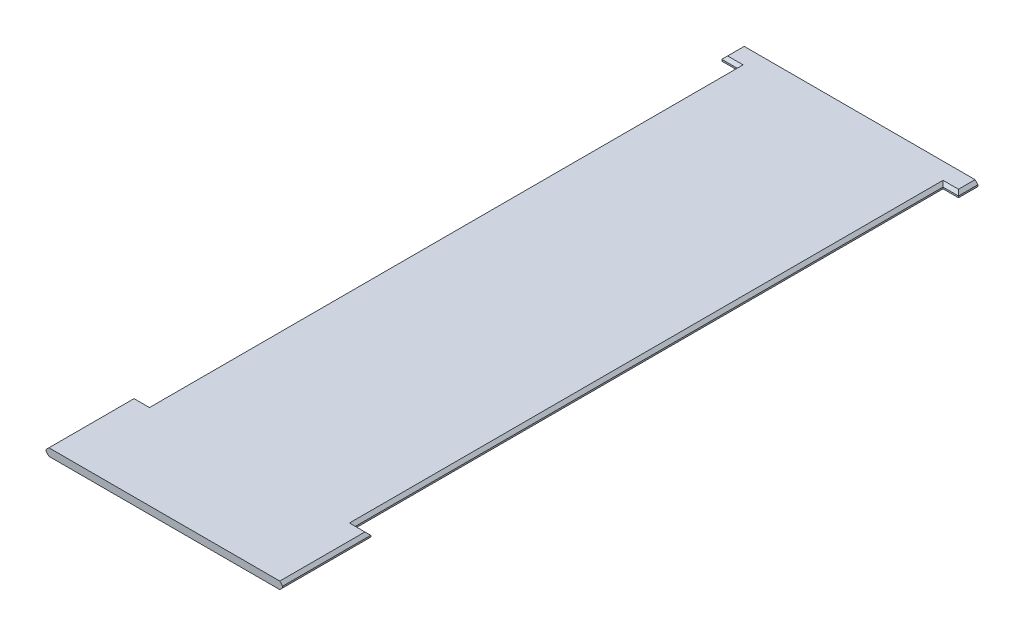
ISO-10303-21;
HEADER;
FILE_DESCRIPTION(('STEP AP214'),'2;1');
FILE_NAME('part.step','',(''),(''),'','','');
FILE_SCHEMA(('AUTOMOTIVE_DESIGN { 1 0 10303 214 1 1 1 1 }'));
ENDSEC;
DATA;
#1=APPLICATION_CONTEXT('core data for automotive mechanical design processes');
#2=APPLICATION_PROTOCOL_DEFINITION('international standard','automotive_design',2000,#1);
#3=PRODUCT_CONTEXT('',#1,'mechanical');
#4=PRODUCT('Part','Part','',(#3));
#5=PRODUCT_RELATED_PRODUCT_CATEGORY('part','',(#4));
#6=PRODUCT_DEFINITION_FORMATION('','',#4);
#7=PRODUCT_DEFINITION_CONTEXT('part definition',#1,'design');
#8=PRODUCT_DEFINITION('design','',#6,#7);
#9=PRODUCT_DEFINITION_SHAPE('','',#8);
#10=(LENGTH_UNIT() NAMED_UNIT(*) SI_UNIT(.MILLI.,.METRE.));
#11=(NAMED_UNIT(*) PLANE_ANGLE_UNIT() SI_UNIT($,.RADIAN.));
#12=(NAMED_UNIT(*) SI_UNIT($,.STERADIAN.) SOLID_ANGLE_UNIT());
#13=UNCERTAINTY_MEASURE_WITH_UNIT(LENGTH_MEASURE(1.E-05),#10,'distance_accuracy_value','');
#14=(GEOMETRIC_REPRESENTATION_CONTEXT(3) GLOBAL_UNCERTAINTY_ASSIGNED_CONTEXT((#13)) GLOBAL_UNIT_ASSIGNED_CONTEXT((#10,
#11,#12)) REPRESENTATION_CONTEXT('',''));
#15=CARTESIAN_POINT('',(0.,0.,0.));
#16=DIRECTION('',(0.,0.,1.));
#17=DIRECTION('',(1.,0.,0.));
#18=AXIS2_PLACEMENT_3D('',#15,#16,#17);
#19=CARTESIAN_POINT('',(553.261641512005,19.05,1566.92811259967));
#20=DIRECTION('',(-1.,0.,0.));
#21=DIRECTION('',(0.,0.,1.));
#22=AXIS2_PLACEMENT_3D('',#19,#20,#21);
#23=PLANE('',#22);
#24=DIRECTION('',(0.,-1.,0.));
#25=VECTOR('',#24,1.);
#26=CARTESIAN_POINT('',(553.261641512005,19.05,2018.12811259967));
#27=LINE('',#26,#25);
#28=CARTESIAN_POINT('',(553.261641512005,4.04999999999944,2018.12811259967));
#29=VERTEX_POINT('',#28);
#30=CARTESIAN_POINT('',(553.261641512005,-4.05000000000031,2018.12811259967));
#31=VERTEX_POINT('',#30);
#32=EDGE_CURVE('E233',#29,#31,#27,.T.);
#33=ORIENTED_EDGE('',*,*,#32,.T.);
#34=DIRECTION('',(0.,0.,-1.));
#35=VECTOR('',#34,1.);
#36=CARTESIAN_POINT('',(553.261641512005,-4.05000000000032,1566.92811259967));
#37=LINE('',#36,#35);
#38=CARTESIAN_POINT('',(553.261641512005,-4.05000000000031,1566.92811259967));
#39=VERTEX_POINT('',#38);
#40=EDGE_CURVE('E11',#31,#39,#37,.T.);
#41=ORIENTED_EDGE('',*,*,#40,.T.);
#42=DIRECTION('',(0.,-1.,0.));
#43=VECTOR('',#42,1.);
#44=CARTESIAN_POINT('',(553.261641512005,19.05,1566.92811259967));
#45=LINE('',#44,#43);
#46=CARTESIAN_POINT('',(553.261641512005,4.04999999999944,1566.92811259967));
#47=VERTEX_POINT('',#46);
#48=EDGE_CURVE('E240',#47,#39,#45,.T.);
#49=ORIENTED_EDGE('',*,*,#48,.F.);
#50=DIRECTION('',(0.,0.,1.));
#51=VECTOR('',#50,1.);
#52=CARTESIAN_POINT('',(553.261641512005,4.04999999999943,1566.92811259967));
#53=LINE('',#52,#51);
#54=EDGE_CURVE('E54',#47,#29,#53,.T.);
#55=ORIENTED_EDGE('',*,*,#54,.T.);
#56=EDGE_LOOP('',(#33,#41,#49,#55));
#57=FACE_BOUND('',#56,.T.);
#58=ADVANCED_FACE('F44',(#57),#23,.F.);
#59=CARTESIAN_POINT('',(474.061641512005,19.05,1566.92811259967));
#60=DIRECTION('',(0.,0.,1.));
#61=DIRECTION('',(1.,0.,0.));
#62=AXIS2_PLACEMENT_3D('',#59,#60,#61);
#63=PLANE('',#62);
#64=ORIENTED_EDGE('',*,*,#48,.T.);
#65=DIRECTION('',(-1.,0.,0.));
#66=VECTOR('',#65,1.);
#67=CARTESIAN_POINT('',(474.061641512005,-4.05000000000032,1566.92811259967));
#68=LINE('',#67,#66);
#69=CARTESIAN_POINT('',(474.061641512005,-4.05000000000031,1566.92811259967));
#70=VERTEX_POINT('',#69);
#71=EDGE_CURVE('E326',#39,#70,#68,.T.);
#72=ORIENTED_EDGE('',*,*,#71,.T.);
#73=DIRECTION('',(0.,-1.,0.));
#74=VECTOR('',#73,1.);
#75=CARTESIAN_POINT('',(474.061641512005,19.05,1566.92811259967));
#76=LINE('',#75,#74);
#77=CARTESIAN_POINT('',(474.061641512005,4.04999999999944,1566.92811259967));
#78=VERTEX_POINT('',#77);
#79=EDGE_CURVE('E241',#78,#70,#76,.T.);
#80=ORIENTED_EDGE('',*,*,#79,.F.);
#81=DIRECTION('',(1.,0.,0.));
#82=VECTOR('',#81,1.);
#83=CARTESIAN_POINT('',(474.061641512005,4.04999999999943,1566.92811259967));
#84=LINE('',#83,#82);
#85=EDGE_CURVE('E70',#78,#47,#84,.T.);
#86=ORIENTED_EDGE('',*,*,#85,.T.);
#87=EDGE_LOOP('',(#64,#72,#80,#86));
#88=FACE_BOUND('',#87,.T.);
#89=ADVANCED_FACE('F540',(#88),#63,.F.);
#90=CARTESIAN_POINT('',(474.061641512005,19.05,-1445.07188740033));
#91=DIRECTION('',(-1.,0.,0.));
#92=DIRECTION('',(0.,0.,1.));
#93=AXIS2_PLACEMENT_3D('',#90,#91,#92);
#94=PLANE('',#93);
#95=ORIENTED_EDGE('',*,*,#79,.T.);
#96=DIRECTION('',(0.,0.,-1.));
#97=VECTOR('',#96,1.);
#98=CARTESIAN_POINT('',(474.061641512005,-4.05000000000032,-1445.07188740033));
#99=LINE('',#98,#97);
#100=CARTESIAN_POINT('',(474.061641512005,-4.05000000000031,-1445.07188740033));
#101=VERTEX_POINT('',#100);
#102=EDGE_CURVE('E321',#70,#101,#99,.T.);
#103=ORIENTED_EDGE('',*,*,#102,.T.);
#104=DIRECTION('',(0.,-1.,0.));
#105=VECTOR('',#104,1.);
#106=CARTESIAN_POINT('',(474.061641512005,19.05,-1445.07188740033));
#107=LINE('',#106,#105);
#108=CARTESIAN_POINT('',(474.061641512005,4.04999999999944,-1445.07188740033));
#109=VERTEX_POINT('',#108);
#110=EDGE_CURVE('E413',#109,#101,#107,.T.);
#111=ORIENTED_EDGE('',*,*,#110,.F.);
#112=DIRECTION('',(0.,0.,1.));
#113=VECTOR('',#112,1.);
#114=CARTESIAN_POINT('',(474.061641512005,4.04999999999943,-1445.07188740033));
#115=LINE('',#114,#113);
#116=EDGE_CURVE('E325',#109,#78,#115,.T.);
#117=ORIENTED_EDGE('',*,*,#116,.T.);
#118=EDGE_LOOP('',(#95,#103,#111,#117));
#119=FACE_BOUND('',#118,.T.);
#120=ADVANCED_FACE('F419',(#119),#94,.F.);
#121=CARTESIAN_POINT('',(474.061641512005,19.05,-1445.07188740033));
#122=DIRECTION('',(0.,0.,-1.));
#123=DIRECTION('',(-1.,0.,0.));
#124=AXIS2_PLACEMENT_3D('',#121,#122,#123);
#125=PLANE('',#124);
#126=ORIENTED_EDGE('',*,*,#110,.T.);
#127=DIRECTION('',(1.,0.,0.));
#128=VECTOR('',#127,1.);
#129=CARTESIAN_POINT('',(553.261641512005,-4.05000000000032,-1445.07188740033));
#130=LINE('',#129,#128);
#131=CARTESIAN_POINT('',(553.261641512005,-4.05000000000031,-1445.07188740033));
#132=VERTEX_POINT('',#131);
#133=EDGE_CURVE('E318',#101,#132,#130,.T.);
#134=ORIENTED_EDGE('',*,*,#133,.T.);
#135=DIRECTION('',(0.,-1.,0.));
#136=VECTOR('',#135,1.);
#137=CARTESIAN_POINT('',(553.261641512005,19.05,-1445.07188740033));
#138=LINE('',#137,#136);
#139=CARTESIAN_POINT('',(553.261641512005,4.04999999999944,-1445.07188740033));
#140=VERTEX_POINT('',#139);
#141=EDGE_CURVE('E414',#140,#132,#138,.T.);
#142=ORIENTED_EDGE('',*,*,#141,.F.);
#143=DIRECTION('',(-1.,0.,0.));
#144=VECTOR('',#143,1.);
#145=CARTESIAN_POINT('',(474.061641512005,4.04999999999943,-1445.07188740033));
#146=LINE('',#145,#144);
#147=EDGE_CURVE('E319',#140,#109,#146,.T.);
#148=ORIENTED_EDGE('',*,*,#147,.T.);
#149=EDGE_LOOP('',(#126,#134,#142,#148));
#150=FACE_BOUND('',#149,.T.);
#151=ADVANCED_FACE('F438',(#150),#125,.F.);
#152=CARTESIAN_POINT('',(553.261641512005,19.05,-1445.07188740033));
#153=DIRECTION('',(-1.,0.,0.));
#154=DIRECTION('',(0.,0.,1.));
#155=AXIS2_PLACEMENT_3D('',#152,#153,#154);
#156=PLANE('',#155);
#157=ORIENTED_EDGE('',*,*,#141,.T.);
#158=DIRECTION('',(0.,0.,-1.));
#159=VECTOR('',#158,1.);
#160=CARTESIAN_POINT('',(553.261641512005,-4.05000000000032,-1545.0718874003));
#161=LINE('',#160,#159);
#162=CARTESIAN_POINT('',(553.261641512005,-4.05000000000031,-1545.0718874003));
#163=VERTEX_POINT('',#162);
#164=EDGE_CURVE('E314',#132,#163,#161,.T.);
#165=ORIENTED_EDGE('',*,*,#164,.T.);
#166=DIRECTION('',(0.,-1.,0.));
#167=VECTOR('',#166,1.);
#168=CARTESIAN_POINT('',(553.261641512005,19.05,-1545.0718874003));
#169=LINE('',#168,#167);
#170=CARTESIAN_POINT('',(553.261641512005,4.04999999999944,-1545.0718874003));
#171=VERTEX_POINT('',#170);
#172=EDGE_CURVE('E409',#171,#163,#169,.T.);
#173=ORIENTED_EDGE('',*,*,#172,.F.);
#174=DIRECTION('',(0.,0.,1.));
#175=VECTOR('',#174,1.);
#176=CARTESIAN_POINT('',(553.261641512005,4.04999999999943,-1445.07188740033));
#177=LINE('',#176,#175);
#178=EDGE_CURVE('E312',#171,#140,#177,.T.);
#179=ORIENTED_EDGE('',*,*,#178,.T.);
#180=EDGE_LOOP('',(#157,#165,#173,#179));
#181=FACE_BOUND('',#180,.T.);
#182=ADVANCED_FACE('F441',(#181),#156,.F.);
#183=CARTESIAN_POINT('',(-659.938358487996,19.05,-1545.0718874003));
#184=DIRECTION('',(0.,0.,1.));
#185=DIRECTION('',(1.,0.,0.));
#186=AXIS2_PLACEMENT_3D('',#183,#184,#185);
#187=PLANE('',#186);
#188=DIRECTION('',(-1.,0.,0.));
#189=VECTOR('',#188,1.);
#190=CARTESIAN_POINT('',(-659.938358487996,-19.05,-1545.0718874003));
#191=LINE('',#190,#189);
#192=CARTESIAN_POINT('',(538.261641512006,-19.05,-1545.0718874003));
#193=VERTEX_POINT('',#192);
#194=CARTESIAN_POINT('',(-644.938358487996,-19.05,-1545.0718874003));
#195=VERTEX_POINT('',#194);
#196=EDGE_CURVE('E344',#193,#195,#191,.T.);
#197=ORIENTED_EDGE('',*,*,#196,.T.);
#198=DIRECTION('',(-0.707106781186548,0.707106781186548,0.));
#199=VECTOR('',#198,1.);
#200=CARTESIAN_POINT('',(-659.938358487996,-4.05000000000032,-1545.0718874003));
#201=LINE('',#200,#199);
#202=CARTESIAN_POINT('',(-659.938358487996,-4.05000000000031,-1545.0718874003));
#203=VERTEX_POINT('',#202);
#204=EDGE_CURVE('E287',#195,#203,#201,.T.);
#205=ORIENTED_EDGE('',*,*,#204,.T.);
#206=DIRECTION('',(0.,-1.,0.));
#207=VECTOR('',#206,1.);
#208=CARTESIAN_POINT('',(-659.938358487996,19.05,-1545.0718874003));
#209=LINE('',#208,#207);
#210=CARTESIAN_POINT('',(-659.938358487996,4.04999999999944,-1545.0718874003));
#211=VERTEX_POINT('',#210);
#212=EDGE_CURVE('E403',#211,#203,#209,.T.);
#213=ORIENTED_EDGE('',*,*,#212,.F.);
#214=DIRECTION('',(-0.707106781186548,-0.707106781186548,0.));
#215=VECTOR('',#214,1.);
#216=CARTESIAN_POINT('',(-644.938358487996,19.05,-1545.0718874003));
#217=LINE('',#216,#215);
#218=CARTESIAN_POINT('',(-644.938358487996,19.05,-1545.0718874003));
#219=VERTEX_POINT('',#218);
#220=EDGE_CURVE('E286',#211,#219,#217,.F.);
#221=ORIENTED_EDGE('',*,*,#220,.T.);
#222=DIRECTION('',(-1.,0.,0.));
#223=VECTOR('',#222,1.);
#224=CARTESIAN_POINT('',(-659.938358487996,19.05,-1545.0718874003));
#225=LINE('',#224,#223);
#226=CARTESIAN_POINT('',(538.261641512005,19.05,-1545.0718874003));
#227=VERTEX_POINT('',#226);
#228=EDGE_CURVE('E386',#227,#219,#225,.T.);
#229=ORIENTED_EDGE('',*,*,#228,.F.);
#230=DIRECTION('',(-0.707106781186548,0.707106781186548,0.));
#231=VECTOR('',#230,1.);
#232=CARTESIAN_POINT('',(538.261641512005,19.05,-1545.0718874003));
#233=LINE('',#232,#231);
#234=EDGE_CURVE('E283',#227,#171,#233,.F.);
#235=ORIENTED_EDGE('',*,*,#234,.T.);
#236=ORIENTED_EDGE('',*,*,#172,.T.);
#237=DIRECTION('',(-0.707106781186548,-0.707106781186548,0.));
#238=VECTOR('',#237,1.);
#239=CARTESIAN_POINT('',(553.261641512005,-4.05000000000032,-1545.0718874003));
#240=LINE('',#239,#238);
#241=EDGE_CURVE('E288',#163,#193,#240,.T.);
#242=ORIENTED_EDGE('',*,*,#241,.T.);
#243=EDGE_LOOP('',(#197,#205,#213,#221,#229,#235,#236,#242));
#244=FACE_BOUND('',#243,.T.);
#245=ADVANCED_FACE('F492',(#244),#187,.F.);
#246=CARTESIAN_POINT('',(-659.938358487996,19.05,-1445.07188740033));
#247=DIRECTION('',(1.,0.,0.));
#248=DIRECTION('',(0.,0.,-1.));
#249=AXIS2_PLACEMENT_3D('',#246,#247,#248);
#250=PLANE('',#249);
#251=ORIENTED_EDGE('',*,*,#212,.T.);
#252=DIRECTION('',(0.,0.,1.));
#253=VECTOR('',#252,1.);
#254=CARTESIAN_POINT('',(-659.938358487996,-4.05000000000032,-1445.07188740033));
#255=LINE('',#254,#253);
#256=CARTESIAN_POINT('',(-659.938358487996,-4.05000000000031,-1445.07188740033));
#257=VERTEX_POINT('',#256);
#258=EDGE_CURVE('E281',#203,#257,#255,.T.);
#259=ORIENTED_EDGE('',*,*,#258,.T.);
#260=DIRECTION('',(0.,-1.,0.));
#261=VECTOR('',#260,1.);
#262=CARTESIAN_POINT('',(-659.938358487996,19.05,-1445.07188740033));
#263=LINE('',#262,#261);
#264=CARTESIAN_POINT('',(-659.938358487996,4.04999999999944,-1445.07188740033));
#265=VERTEX_POINT('',#264);
#266=EDGE_CURVE('E405',#265,#257,#263,.T.);
#267=ORIENTED_EDGE('',*,*,#266,.F.);
#268=DIRECTION('',(0.,0.,-1.));
#269=VECTOR('',#268,1.);
#270=CARTESIAN_POINT('',(-659.938358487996,4.04999999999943,-1445.07188740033));
#271=LINE('',#270,#269);
#272=EDGE_CURVE('E278',#265,#211,#271,.T.);
#273=ORIENTED_EDGE('',*,*,#272,.T.);
#274=EDGE_LOOP('',(#251,#259,#267,#273));
#275=FACE_BOUND('',#274,.T.);
#276=ADVANCED_FACE('F484',(#275),#250,.F.);
#277=CARTESIAN_POINT('',(-580.738358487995,19.05,-1445.07188740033));
#278=DIRECTION('',(0.,0.,-1.));
#279=DIRECTION('',(-1.,0.,0.));
#280=AXIS2_PLACEMENT_3D('',#277,#278,#279);
#281=PLANE('',#280);
#282=ORIENTED_EDGE('',*,*,#266,.T.);
#283=DIRECTION('',(1.,0.,0.));
#284=VECTOR('',#283,1.);
#285=CARTESIAN_POINT('',(-580.738358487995,-4.05000000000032,-1445.07188740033));
#286=LINE('',#285,#284);
#287=CARTESIAN_POINT('',(-580.738358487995,-4.05000000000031,-1445.07188740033));
#288=VERTEX_POINT('',#287);
#289=EDGE_CURVE('E279',#257,#288,#286,.T.);
#290=ORIENTED_EDGE('',*,*,#289,.T.);
#291=DIRECTION('',(0.,-1.,0.));
#292=VECTOR('',#291,1.);
#293=CARTESIAN_POINT('',(-580.738358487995,19.05,-1445.07188740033));
#294=LINE('',#293,#292);
#295=CARTESIAN_POINT('',(-580.738358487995,4.04999999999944,-1445.07188740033));
#296=VERTEX_POINT('',#295);
#297=EDGE_CURVE('E399',#296,#288,#294,.T.);
#298=ORIENTED_EDGE('',*,*,#297,.F.);
#299=DIRECTION('',(-1.,0.,0.));
#300=VECTOR('',#299,1.);
#301=CARTESIAN_POINT('',(-580.738358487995,4.04999999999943,-1445.07188740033));
#302=LINE('',#301,#300);
#303=EDGE_CURVE('E277',#296,#265,#302,.T.);
#304=ORIENTED_EDGE('',*,*,#303,.T.);
#305=EDGE_LOOP('',(#282,#290,#298,#304));
#306=FACE_BOUND('',#305,.T.);
#307=ADVANCED_FACE('F477',(#306),#281,.F.);
#308=CARTESIAN_POINT('',(-580.738358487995,19.05,1566.92811259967));
#309=DIRECTION('',(1.,0.,0.));
#310=DIRECTION('',(0.,0.,-1.));
#311=AXIS2_PLACEMENT_3D('',#308,#309,#310);
#312=PLANE('',#311);
#313=ORIENTED_EDGE('',*,*,#297,.T.);
#314=DIRECTION('',(0.,0.,1.));
#315=VECTOR('',#314,1.);
#316=CARTESIAN_POINT('',(-580.738358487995,-4.05000000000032,1566.92811259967));
#317=LINE('',#316,#315);
#318=CARTESIAN_POINT('',(-580.738358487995,-4.05000000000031,1566.92811259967));
#319=VERTEX_POINT('',#318);
#320=EDGE_CURVE('E274',#288,#319,#317,.T.);
#321=ORIENTED_EDGE('',*,*,#320,.T.);
#322=DIRECTION('',(0.,-1.,0.));
#323=VECTOR('',#322,1.);
#324=CARTESIAN_POINT('',(-580.738358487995,19.05,1566.92811259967));
#325=LINE('',#324,#323);
#326=CARTESIAN_POINT('',(-580.738358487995,4.04999999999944,1566.92811259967));
#327=VERTEX_POINT('',#326);
#328=EDGE_CURVE('E398',#327,#319,#325,.T.);
#329=ORIENTED_EDGE('',*,*,#328,.F.);
#330=DIRECTION('',(0.,0.,-1.));
#331=VECTOR('',#330,1.);
#332=CARTESIAN_POINT('',(-580.738358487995,4.04999999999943,1566.92811259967));
#333=LINE('',#332,#331);
#334=EDGE_CURVE('E275',#327,#296,#333,.T.);
#335=ORIENTED_EDGE('',*,*,#334,.T.);
#336=EDGE_LOOP('',(#313,#321,#329,#335));
#337=FACE_BOUND('',#336,.T.);
#338=ADVANCED_FACE('F470',(#337),#312,.F.);
#339=CARTESIAN_POINT('',(-659.938358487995,19.05,1566.92811259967));
#340=DIRECTION('',(0.,0.,1.));
#341=DIRECTION('',(1.,0.,0.));
#342=AXIS2_PLACEMENT_3D('',#339,#340,#341);
#343=PLANE('',#342);
#344=ORIENTED_EDGE('',*,*,#328,.T.);
#345=DIRECTION('',(-1.,0.,0.));
#346=VECTOR('',#345,1.);
#347=CARTESIAN_POINT('',(-659.938358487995,-4.05000000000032,1566.92811259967));
#348=LINE('',#347,#346);
#349=CARTESIAN_POINT('',(-659.938358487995,-4.05000000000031,1566.92811259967));
#350=VERTEX_POINT('',#349);
#351=EDGE_CURVE('E267',#319,#350,#348,.T.);
#352=ORIENTED_EDGE('',*,*,#351,.T.);
#353=DIRECTION('',(0.,-1.,0.));
#354=VECTOR('',#353,1.);
#355=CARTESIAN_POINT('',(-659.938358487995,19.05,1566.92811259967));
#356=LINE('',#355,#354);
#357=CARTESIAN_POINT('',(-659.938358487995,4.04999999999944,1566.92811259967));
#358=VERTEX_POINT('',#357);
#359=EDGE_CURVE('E229',#358,#350,#356,.T.);
#360=ORIENTED_EDGE('',*,*,#359,.F.);
#361=DIRECTION('',(1.,0.,0.));
#362=VECTOR('',#361,1.);
#363=CARTESIAN_POINT('',(-659.938358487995,4.04999999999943,1566.92811259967));
#364=LINE('',#363,#362);
#365=EDGE_CURVE('E266',#358,#327,#364,.T.);
#366=ORIENTED_EDGE('',*,*,#365,.T.);
#367=EDGE_LOOP('',(#344,#352,#360,#366));
#368=FACE_BOUND('',#367,.T.);
#369=ADVANCED_FACE('F461',(#368),#343,.F.);
#370=CARTESIAN_POINT('',(-659.938358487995,19.05,2018.12811259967));
#371=DIRECTION('',(1.,0.,0.));
#372=DIRECTION('',(0.,0.,-1.));
#373=AXIS2_PLACEMENT_3D('',#370,#371,#372);
#374=PLANE('',#373);
#375=ORIENTED_EDGE('',*,*,#359,.T.);
#376=DIRECTION('',(0.,0.,1.));
#377=VECTOR('',#376,1.);
#378=CARTESIAN_POINT('',(-659.938358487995,-4.05000000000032,2018.12811259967));
#379=LINE('',#378,#377);
#380=CARTESIAN_POINT('',(-659.938358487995,-4.05000000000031,2018.12811259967));
#381=VERTEX_POINT('',#380);
#382=EDGE_CURVE('E230',#350,#381,#379,.T.);
#383=ORIENTED_EDGE('',*,*,#382,.T.);
#384=DIRECTION('',(0.,-1.,0.));
#385=VECTOR('',#384,1.);
#386=CARTESIAN_POINT('',(-659.938358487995,19.05,2018.12811259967));
#387=LINE('',#386,#385);
#388=CARTESIAN_POINT('',(-659.938358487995,4.04999999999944,2018.12811259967));
#389=VERTEX_POINT('',#388);
#390=EDGE_CURVE('E215',#389,#381,#387,.T.);
#391=ORIENTED_EDGE('',*,*,#390,.F.);
#392=DIRECTION('',(0.,0.,-1.));
#393=VECTOR('',#392,1.);
#394=CARTESIAN_POINT('',(-659.938358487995,4.04999999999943,2018.12811259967));
#395=LINE('',#394,#393);
#396=EDGE_CURVE('E228',#389,#358,#395,.T.);
#397=ORIENTED_EDGE('',*,*,#396,.T.);
#398=EDGE_LOOP('',(#375,#383,#391,#397));
#399=FACE_BOUND('',#398,.T.);
#400=ADVANCED_FACE('F222',(#399),#374,.F.);
#401=CARTESIAN_POINT('',(553.261641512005,19.05,2018.12811259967));
#402=DIRECTION('',(0.,0.,-1.));
#403=DIRECTION('',(-1.,0.,0.));
#404=AXIS2_PLACEMENT_3D('',#401,#402,#403);
#405=PLANE('',#404);
#406=ORIENTED_EDGE('',*,*,#390,.T.);
#407=DIRECTION('',(0.707106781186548,-0.707106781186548,0.));
#408=VECTOR('',#407,1.);
#409=CARTESIAN_POINT('',(-659.938358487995,-4.05000000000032,2018.12811259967));
#410=LINE('',#409,#408);
#411=CARTESIAN_POINT('',(-644.938358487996,-19.05,2018.12811259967));
#412=VERTEX_POINT('',#411);
#413=EDGE_CURVE('E218',#381,#412,#410,.T.);
#414=ORIENTED_EDGE('',*,*,#413,.T.);
#415=DIRECTION('',(1.,0.,0.));
#416=VECTOR('',#415,1.);
#417=CARTESIAN_POINT('',(553.261641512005,-19.05,2018.12811259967));
#418=LINE('',#417,#416);
#419=CARTESIAN_POINT('',(538.261641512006,-19.05,2018.12811259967));
#420=VERTEX_POINT('',#419);
#421=EDGE_CURVE('E391',#412,#420,#418,.T.);
#422=ORIENTED_EDGE('',*,*,#421,.T.);
#423=DIRECTION('',(0.707106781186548,0.707106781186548,0.));
#424=VECTOR('',#423,1.);
#425=CARTESIAN_POINT('',(553.261641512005,-4.05000000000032,2018.12811259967));
#426=LINE('',#425,#424);
#427=EDGE_CURVE('E217',#420,#31,#426,.T.);
#428=ORIENTED_EDGE('',*,*,#427,.T.);
#429=ORIENTED_EDGE('',*,*,#32,.F.);
#430=DIRECTION('',(0.707106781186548,-0.707106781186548,0.));
#431=VECTOR('',#430,1.);
#432=CARTESIAN_POINT('',(538.261641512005,19.05,2018.12811259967));
#433=LINE('',#432,#431);
#434=CARTESIAN_POINT('',(538.261641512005,19.05,2018.12811259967));
#435=VERTEX_POINT('',#434);
#436=EDGE_CURVE('E237',#29,#435,#433,.F.);
#437=ORIENTED_EDGE('',*,*,#436,.T.);
#438=DIRECTION('',(1.,0.,0.));
#439=VECTOR('',#438,1.);
#440=CARTESIAN_POINT('',(553.261641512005,19.05,2018.12811259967));
#441=LINE('',#440,#439);
#442=CARTESIAN_POINT('',(-644.938358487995,19.05,2018.12811259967));
#443=VERTEX_POINT('',#442);
#444=EDGE_CURVE('E211',#443,#435,#441,.T.);
#445=ORIENTED_EDGE('',*,*,#444,.F.);
#446=DIRECTION('',(0.707106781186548,0.707106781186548,0.));
#447=VECTOR('',#446,1.);
#448=CARTESIAN_POINT('',(-644.938358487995,19.05,2018.12811259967));
#449=LINE('',#448,#447);
#450=EDGE_CURVE('E209',#443,#389,#449,.F.);
#451=ORIENTED_EDGE('',*,*,#450,.T.);
#452=EDGE_LOOP('',(#406,#414,#422,#428,#429,#437,#445,#451));
#453=FACE_BOUND('',#452,.T.);
#454=ADVANCED_FACE('F212',(#453),#405,.F.);
#455=CARTESIAN_POINT('',(0.,19.05,0.));
#456=DIRECTION('',(0.,-1.,0.));
#457=DIRECTION('',(0.,0.,-1.));
#458=AXIS2_PLACEMENT_3D('',#455,#456,#457);
#459=PLANE('',#458);
#460=DIRECTION('',(-1.,0.,0.));
#461=VECTOR('',#460,1.);
#462=CARTESIAN_POINT('',(0.,19.05,1581.92811259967));
#463=LINE('',#462,#461);
#464=CARTESIAN_POINT('',(-565.738358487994,19.05,1581.92811259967));
#465=VERTEX_POINT('',#464);
#466=CARTESIAN_POINT('',(-644.938358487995,19.05,1581.92811259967));
#467=VERTEX_POINT('',#466);
#468=EDGE_CURVE('E307',#465,#467,#463,.T.);
#469=ORIENTED_EDGE('',*,*,#468,.T.);
#470=DIRECTION('',(0.,0.,1.));
#471=VECTOR('',#470,1.);
#472=CARTESIAN_POINT('',(-644.938358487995,19.05,0.));
#473=LINE('',#472,#471);
#474=EDGE_CURVE('E311',#467,#443,#473,.T.);
#475=ORIENTED_EDGE('',*,*,#474,.T.);
#476=ORIENTED_EDGE('',*,*,#444,.T.);
#477=DIRECTION('',(0.,0.,-1.));
#478=VECTOR('',#477,1.);
#479=CARTESIAN_POINT('',(538.261641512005,19.05,0.));
#480=LINE('',#479,#478);
#481=CARTESIAN_POINT('',(538.261641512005,19.05,1581.92811259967));
#482=VERTEX_POINT('',#481);
#483=EDGE_CURVE('E292',#435,#482,#480,.T.);
#484=ORIENTED_EDGE('',*,*,#483,.T.);
#485=DIRECTION('',(-1.,0.,0.));
#486=VECTOR('',#485,1.);
#487=CARTESIAN_POINT('',(0.,19.05,1581.92811259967));
#488=LINE('',#487,#486);
#489=CARTESIAN_POINT('',(459.061641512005,19.05,1581.92811259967));
#490=VERTEX_POINT('',#489);
#491=EDGE_CURVE('E295',#482,#490,#488,.T.);
#492=ORIENTED_EDGE('',*,*,#491,.T.);
#493=DIRECTION('',(0.,0.,-1.));
#494=VECTOR('',#493,1.);
#495=CARTESIAN_POINT('',(459.061641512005,19.05,0.));
#496=LINE('',#495,#494);
#497=CARTESIAN_POINT('',(459.061641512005,19.05,-1460.07188740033));
#498=VERTEX_POINT('',#497);
#499=EDGE_CURVE('E298',#490,#498,#496,.T.);
#500=ORIENTED_EDGE('',*,*,#499,.T.);
#501=DIRECTION('',(1.,0.,0.));
#502=VECTOR('',#501,1.);
#503=CARTESIAN_POINT('',(0.,19.05,-1460.07188740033));
#504=LINE('',#503,#502);
#505=CARTESIAN_POINT('',(538.261641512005,19.05,-1460.07188740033));
#506=VERTEX_POINT('',#505);
#507=EDGE_CURVE('E296',#498,#506,#504,.T.);
#508=ORIENTED_EDGE('',*,*,#507,.T.);
#509=DIRECTION('',(0.,0.,-1.));
#510=VECTOR('',#509,1.);
#511=CARTESIAN_POINT('',(538.261641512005,19.05,0.));
#512=LINE('',#511,#510);
#513=EDGE_CURVE('E297',#506,#227,#512,.T.);
#514=ORIENTED_EDGE('',*,*,#513,.T.);
#515=ORIENTED_EDGE('',*,*,#228,.T.);
#516=DIRECTION('',(0.,0.,1.));
#517=VECTOR('',#516,1.);
#518=CARTESIAN_POINT('',(-644.938358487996,19.05,0.));
#519=LINE('',#518,#517);
#520=CARTESIAN_POINT('',(-644.938358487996,19.05,-1460.07188740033));
#521=VERTEX_POINT('',#520);
#522=EDGE_CURVE('E303',#219,#521,#519,.T.);
#523=ORIENTED_EDGE('',*,*,#522,.T.);
#524=DIRECTION('',(1.,0.,0.));
#525=VECTOR('',#524,1.);
#526=CARTESIAN_POINT('',(0.,19.05,-1460.07188740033));
#527=LINE('',#526,#525);
#528=CARTESIAN_POINT('',(-565.738358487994,19.05,-1460.07188740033));
#529=VERTEX_POINT('',#528);
#530=EDGE_CURVE('E304',#521,#529,#527,.T.);
#531=ORIENTED_EDGE('',*,*,#530,.T.);
#532=DIRECTION('',(0.,0.,1.));
#533=VECTOR('',#532,1.);
#534=CARTESIAN_POINT('',(-565.738358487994,19.05,0.));
#535=LINE('',#534,#533);
#536=EDGE_CURVE('E310',#529,#465,#535,.T.);
#537=ORIENTED_EDGE('',*,*,#536,.T.);
#538=EDGE_LOOP('',(#469,#475,#476,#484,#492,#500,#508,#514,#515,#523,#531,#537));
#539=FACE_BOUND('',#538,.T.);
#540=ADVANCED_FACE('F451',(#539),#459,.F.);
#541=CARTESIAN_POINT('',(0.,-19.05,0.));
#542=DIRECTION('',(0.,-1.,0.));
#543=DIRECTION('',(0.,0.,-1.));
#544=AXIS2_PLACEMENT_3D('',#541,#542,#543);
#545=PLANE('',#544);
#546=ORIENTED_EDGE('',*,*,#421,.F.);
#547=DIRECTION('',(0.,0.,-1.));
#548=VECTOR('',#547,1.);
#549=CARTESIAN_POINT('',(-644.938358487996,-19.05,1566.92811259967));
#550=LINE('',#549,#548);
#551=CARTESIAN_POINT('',(-644.938358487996,-19.05,1581.92811259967));
#552=VERTEX_POINT('',#551);
#553=EDGE_CURVE('E268',#412,#552,#550,.T.);
#554=ORIENTED_EDGE('',*,*,#553,.T.);
#555=DIRECTION('',(1.,0.,0.));
#556=VECTOR('',#555,1.);
#557=CARTESIAN_POINT('',(-580.738358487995,-19.05,1581.92811259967));
#558=LINE('',#557,#556);
#559=CARTESIAN_POINT('',(-565.738358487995,-19.05,1581.92811259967));
#560=VERTEX_POINT('',#559);
#561=EDGE_CURVE('E263',#552,#560,#558,.T.);
#562=ORIENTED_EDGE('',*,*,#561,.T.);
#563=DIRECTION('',(0.,0.,-1.));
#564=VECTOR('',#563,1.);
#565=CARTESIAN_POINT('',(-565.738358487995,-19.05,-1445.07188740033));
#566=LINE('',#565,#564);
#567=CARTESIAN_POINT('',(-565.738358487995,-19.05,-1460.07188740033));
#568=VERTEX_POINT('',#567);
#569=EDGE_CURVE('E261',#560,#568,#566,.T.);
#570=ORIENTED_EDGE('',*,*,#569,.T.);
#571=DIRECTION('',(-1.,0.,0.));
#572=VECTOR('',#571,1.);
#573=CARTESIAN_POINT('',(-659.938358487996,-19.05,-1460.07188740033));
#574=LINE('',#573,#572);
#575=CARTESIAN_POINT('',(-644.938358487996,-19.05,-1460.07188740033));
#576=VERTEX_POINT('',#575);
#577=EDGE_CURVE('E258',#568,#576,#574,.T.);
#578=ORIENTED_EDGE('',*,*,#577,.T.);
#579=DIRECTION('',(0.,0.,-1.));
#580=VECTOR('',#579,1.);
#581=CARTESIAN_POINT('',(-644.938358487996,-19.05,-1545.0718874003));
#582=LINE('',#581,#580);
#583=EDGE_CURVE('E259',#576,#195,#582,.T.);
#584=ORIENTED_EDGE('',*,*,#583,.T.);
#585=ORIENTED_EDGE('',*,*,#196,.F.);
#586=DIRECTION('',(0.,0.,1.));
#587=VECTOR('',#586,1.);
#588=CARTESIAN_POINT('',(538.261641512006,-19.05,-1445.07188740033));
#589=LINE('',#588,#587);
#590=CARTESIAN_POINT('',(538.261641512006,-19.05,-1460.07188740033));
#591=VERTEX_POINT('',#590);
#592=EDGE_CURVE('E257',#193,#591,#589,.T.);
#593=ORIENTED_EDGE('',*,*,#592,.T.);
#594=DIRECTION('',(-1.,0.,0.));
#595=VECTOR('',#594,1.);
#596=CARTESIAN_POINT('',(474.061641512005,-19.05,-1460.07188740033));
#597=LINE('',#596,#595);
#598=CARTESIAN_POINT('',(459.061641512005,-19.05,-1460.07188740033));
#599=VERTEX_POINT('',#598);
#600=EDGE_CURVE('E251',#591,#599,#597,.T.);
#601=ORIENTED_EDGE('',*,*,#600,.T.);
#602=DIRECTION('',(0.,0.,1.));
#603=VECTOR('',#602,1.);
#604=CARTESIAN_POINT('',(459.061641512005,-19.05,1566.92811259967));
#605=LINE('',#604,#603);
#606=CARTESIAN_POINT('',(459.061641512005,-19.05,1581.92811259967));
#607=VERTEX_POINT('',#606);
#608=EDGE_CURVE('E255',#599,#607,#605,.T.);
#609=ORIENTED_EDGE('',*,*,#608,.T.);
#610=DIRECTION('',(1.,0.,0.));
#611=VECTOR('',#610,1.);
#612=CARTESIAN_POINT('',(553.261641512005,-19.05,1581.92811259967));
#613=LINE('',#612,#611);
#614=CARTESIAN_POINT('',(538.261641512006,-19.05,1581.92811259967));
#615=VERTEX_POINT('',#614);
#616=EDGE_CURVE('E249',#607,#615,#613,.T.);
#617=ORIENTED_EDGE('',*,*,#616,.T.);
#618=DIRECTION('',(0.,0.,1.));
#619=VECTOR('',#618,1.);
#620=CARTESIAN_POINT('',(538.261641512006,-19.05,2018.12811259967));
#621=LINE('',#620,#619);
#622=EDGE_CURVE('E247',#615,#420,#621,.T.);
#623=ORIENTED_EDGE('',*,*,#622,.T.);
#624=EDGE_LOOP('',(#546,#554,#562,#570,#578,#584,#585,#593,#601,#609,#617,#623));
#625=FACE_BOUND('',#624,.T.);
#626=ADVANCED_FACE('F524',(#625),#545,.T.);
#627=CARTESIAN_POINT('',(-659.938358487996,-4.05000000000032,-1445.07188740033));
#628=DIRECTION('',(-0.707106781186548,-0.707106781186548,0.));
#629=DIRECTION('',(0.,0.,-1.));
#630=AXIS2_PLACEMENT_3D('',#627,#628,#629);
#631=PLANE('',#630);
#632=ORIENTED_EDGE('',*,*,#204,.F.);
#633=ORIENTED_EDGE('',*,*,#583,.F.);
#634=DIRECTION('',(-0.577350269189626,0.577350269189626,0.577350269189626));
#635=VECTOR('',#634,1.);
#636=CARTESIAN_POINT('',(-659.938358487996,-4.05000000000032,-1445.07188740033));
#637=LINE('',#636,#635);
#638=EDGE_CURVE('E338',#257,#576,#637,.F.);
#639=ORIENTED_EDGE('',*,*,#638,.F.);
#640=ORIENTED_EDGE('',*,*,#258,.F.);
#641=EDGE_LOOP('',(#632,#633,#639,#640));
#642=FACE_BOUND('',#641,.T.);
#643=ADVANCED_FACE('F503',(#642),#631,.T.);
#644=CARTESIAN_POINT('',(-580.738358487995,-4.05000000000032,-1445.07188740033));
#645=DIRECTION('',(0.,-0.707106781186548,0.707106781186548));
#646=DIRECTION('',(-1.,0.,0.));
#647=AXIS2_PLACEMENT_3D('',#644,#645,#646);
#648=PLANE('',#647);
#649=ORIENTED_EDGE('',*,*,#638,.T.);
#650=ORIENTED_EDGE('',*,*,#577,.F.);
#651=DIRECTION('',(-0.577350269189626,0.577350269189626,0.577350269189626));
#652=VECTOR('',#651,1.);
#653=CARTESIAN_POINT('',(-1584.73835848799,999.949999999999,-441.071887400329));
#654=LINE('',#653,#652);
#655=EDGE_CURVE('E340',#288,#568,#654,.F.);
#656=ORIENTED_EDGE('',*,*,#655,.F.);
#657=ORIENTED_EDGE('',*,*,#289,.F.);
#658=EDGE_LOOP('',(#649,#650,#656,#657));
#659=FACE_BOUND('',#658,.T.);
#660=ADVANCED_FACE('F507',(#659),#648,.T.);
#661=CARTESIAN_POINT('',(-580.738358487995,-4.05000000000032,1566.92811259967));
#662=DIRECTION('',(-0.707106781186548,-0.707106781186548,0.));
#663=DIRECTION('',(0.,0.,-1.));
#664=AXIS2_PLACEMENT_3D('',#661,#662,#663);
#665=PLANE('',#664);
#666=ORIENTED_EDGE('',*,*,#655,.T.);
#667=ORIENTED_EDGE('',*,*,#569,.F.);
#668=DIRECTION('',(-0.577350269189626,0.577350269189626,-0.577350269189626));
#669=VECTOR('',#668,1.);
#670=CARTESIAN_POINT('',(-607.138358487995,22.3499999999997,1540.52811259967));
#671=LINE('',#670,#669);
#672=EDGE_CURVE('E331',#319,#560,#671,.F.);
#673=ORIENTED_EDGE('',*,*,#672,.F.);
#674=ORIENTED_EDGE('',*,*,#320,.F.);
#675=EDGE_LOOP('',(#666,#667,#673,#674));
#676=FACE_BOUND('',#675,.T.);
#677=ADVANCED_FACE('F512',(#676),#665,.T.);
#678=CARTESIAN_POINT('',(-659.938358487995,-4.05000000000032,1566.92811259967));
#679=DIRECTION('',(0.,-0.707106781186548,-0.707106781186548));
#680=DIRECTION('',(1.,0.,0.));
#681=AXIS2_PLACEMENT_3D('',#678,#679,#680);
#682=PLANE('',#681);
#683=ORIENTED_EDGE('',*,*,#672,.T.);
#684=ORIENTED_EDGE('',*,*,#561,.F.);
#685=DIRECTION('',(-0.577350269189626,0.577350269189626,-0.577350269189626));
#686=VECTOR('',#685,1.);
#687=CARTESIAN_POINT('',(-659.938358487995,-4.05000000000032,1566.92811259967));
#688=LINE('',#687,#686);
#689=EDGE_CURVE('E327',#350,#552,#688,.F.);
#690=ORIENTED_EDGE('',*,*,#689,.F.);
#691=ORIENTED_EDGE('',*,*,#351,.F.);
#692=EDGE_LOOP('',(#683,#684,#690,#691));
#693=FACE_BOUND('',#692,.T.);
#694=ADVANCED_FACE('F517',(#693),#682,.T.);
#695=CARTESIAN_POINT('',(-659.938358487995,-4.05000000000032,2018.12811259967));
#696=DIRECTION('',(-0.707106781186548,-0.707106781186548,0.));
#697=DIRECTION('',(0.,0.,-1.));
#698=AXIS2_PLACEMENT_3D('',#695,#696,#697);
#699=PLANE('',#698);
#700=ORIENTED_EDGE('',*,*,#689,.T.);
#701=ORIENTED_EDGE('',*,*,#553,.F.);
#702=ORIENTED_EDGE('',*,*,#413,.F.);
#703=ORIENTED_EDGE('',*,*,#382,.F.);
#704=EDGE_LOOP('',(#700,#701,#702,#703));
#705=FACE_BOUND('',#704,.T.);
#706=ADVANCED_FACE('F516',(#705),#699,.T.);
#707=CARTESIAN_POINT('',(-644.938358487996,19.05,0.));
#708=DIRECTION('',(0.707106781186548,-0.707106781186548,0.));
#709=DIRECTION('',(0.,0.,1.));
#710=AXIS2_PLACEMENT_3D('',#707,#708,#709);
#711=PLANE('',#710);
#712=ORIENTED_EDGE('',*,*,#220,.F.);
#713=ORIENTED_EDGE('',*,*,#272,.F.);
#714=DIRECTION('',(0.577350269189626,0.577350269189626,-0.577350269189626));
#715=VECTOR('',#714,1.);
#716=CARTESIAN_POINT('',(-1131.62898762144,-467.640629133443,-973.381258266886));
#717=LINE('',#716,#715);
#718=EDGE_CURVE('E334',#521,#265,#717,.F.);
#719=ORIENTED_EDGE('',*,*,#718,.F.);
#720=ORIENTED_EDGE('',*,*,#522,.F.);
#721=EDGE_LOOP('',(#712,#713,#719,#720));
#722=FACE_BOUND('',#721,.T.);
#723=ADVANCED_FACE('F490',(#722),#711,.F.);
#724=CARTESIAN_POINT('',(0.,19.05,-1460.07188740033));
#725=DIRECTION('',(0.,-0.707106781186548,-0.707106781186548));
#726=DIRECTION('',(1.,0.,0.));
#727=AXIS2_PLACEMENT_3D('',#724,#725,#726);
#728=PLANE('',#727);
#729=ORIENTED_EDGE('',*,*,#718,.T.);
#730=ORIENTED_EDGE('',*,*,#303,.F.);
#731=DIRECTION('',(0.577350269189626,0.577350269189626,-0.577350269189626));
#732=VECTOR('',#731,1.);
#733=CARTESIAN_POINT('',(-1052.42898762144,-467.640629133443,-973.381258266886));
#734=LINE('',#733,#732);
#735=EDGE_CURVE('E348',#529,#296,#734,.F.);
#736=ORIENTED_EDGE('',*,*,#735,.F.);
#737=ORIENTED_EDGE('',*,*,#530,.F.);
#738=EDGE_LOOP('',(#729,#730,#736,#737));
#739=FACE_BOUND('',#738,.T.);
#740=ADVANCED_FACE('F479',(#739),#728,.F.);
#741=CARTESIAN_POINT('',(-565.738358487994,19.05,0.));
#742=DIRECTION('',(0.707106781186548,-0.707106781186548,0.));
#743=DIRECTION('',(0.,0.,1.));
#744=AXIS2_PLACEMENT_3D('',#741,#742,#743);
#745=PLANE('',#744);
#746=ORIENTED_EDGE('',*,*,#735,.T.);
#747=ORIENTED_EDGE('',*,*,#334,.F.);
#748=DIRECTION('',(0.577350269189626,0.577350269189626,0.577350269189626));
#749=VECTOR('',#748,1.);
#750=CARTESIAN_POINT('',(-377.158905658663,207.629452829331,1770.507565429));
#751=LINE('',#750,#749);
#752=EDGE_CURVE('E343',#465,#327,#751,.F.);
#753=ORIENTED_EDGE('',*,*,#752,.F.);
#754=ORIENTED_EDGE('',*,*,#536,.F.);
#755=EDGE_LOOP('',(#746,#747,#753,#754));
#756=FACE_BOUND('',#755,.T.);
#757=ADVANCED_FACE('F472',(#756),#745,.F.);
#758=CARTESIAN_POINT('',(0.,19.05,1581.92811259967));
#759=DIRECTION('',(0.,-0.707106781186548,0.707106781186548));
#760=DIRECTION('',(-1.,0.,0.));
#761=AXIS2_PLACEMENT_3D('',#758,#759,#760);
#762=PLANE('',#761);
#763=ORIENTED_EDGE('',*,*,#752,.T.);
#764=ORIENTED_EDGE('',*,*,#365,.F.);
#765=DIRECTION('',(0.577350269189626,0.577350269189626,0.577350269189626));
#766=VECTOR('',#765,1.);
#767=CARTESIAN_POINT('',(-429.958905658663,234.029452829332,1796.907565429));
#768=LINE('',#767,#766);
#769=EDGE_CURVE('E236',#467,#358,#768,.F.);
#770=ORIENTED_EDGE('',*,*,#769,.F.);
#771=ORIENTED_EDGE('',*,*,#468,.F.);
#772=EDGE_LOOP('',(#763,#764,#770,#771));
#773=FACE_BOUND('',#772,.T.);
#774=ADVANCED_FACE('F457',(#773),#762,.F.);
#775=CARTESIAN_POINT('',(-644.938358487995,19.05,0.));
#776=DIRECTION('',(0.707106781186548,-0.707106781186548,0.));
#777=DIRECTION('',(0.,0.,1.));
#778=AXIS2_PLACEMENT_3D('',#775,#776,#777);
#779=PLANE('',#778);
#780=ORIENTED_EDGE('',*,*,#769,.T.);
#781=ORIENTED_EDGE('',*,*,#396,.F.);
#782=ORIENTED_EDGE('',*,*,#450,.F.);
#783=ORIENTED_EDGE('',*,*,#474,.F.);
#784=EDGE_LOOP('',(#780,#781,#782,#783));
#785=FACE_BOUND('',#784,.T.);
#786=ADVANCED_FACE('F234',(#785),#779,.F.);
#787=CARTESIAN_POINT('',(553.261641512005,-4.05000000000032,1566.92811259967));
#788=DIRECTION('',(0.707106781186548,-0.707106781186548,0.));
#789=DIRECTION('',(0.,0.,1.));
#790=AXIS2_PLACEMENT_3D('',#787,#788,#789);
#791=PLANE('',#790);
#792=ORIENTED_EDGE('',*,*,#427,.F.);
#793=ORIENTED_EDGE('',*,*,#622,.F.);
#794=DIRECTION('',(0.577350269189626,0.577350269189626,-0.577350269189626));
#795=VECTOR('',#794,1.);
#796=CARTESIAN_POINT('',(553.261641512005,-4.05000000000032,1566.92811259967));
#797=LINE('',#796,#795);
#798=EDGE_CURVE('E349',#39,#615,#797,.F.);
#799=ORIENTED_EDGE('',*,*,#798,.F.);
#800=ORIENTED_EDGE('',*,*,#40,.F.);
#801=EDGE_LOOP('',(#792,#793,#799,#800));
#802=FACE_BOUND('',#801,.T.);
#803=ADVANCED_FACE('F522',(#802),#791,.T.);
#804=CARTESIAN_POINT('',(474.061641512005,-4.05000000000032,1566.92811259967));
#805=DIRECTION('',(0.,-0.707106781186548,-0.707106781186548));
#806=DIRECTION('',(1.,0.,0.));
#807=AXIS2_PLACEMENT_3D('',#804,#805,#806);
#808=PLANE('',#807);
#809=ORIENTED_EDGE('',*,*,#798,.T.);
#810=ORIENTED_EDGE('',*,*,#616,.F.);
#811=DIRECTION('',(0.577350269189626,0.577350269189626,-0.577350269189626));
#812=VECTOR('',#811,1.);
#813=CARTESIAN_POINT('',(1478.061641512,999.949999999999,562.92811259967));
#814=LINE('',#813,#812);
#815=EDGE_CURVE('E359',#70,#607,#814,.F.);
#816=ORIENTED_EDGE('',*,*,#815,.F.);
#817=ORIENTED_EDGE('',*,*,#71,.F.);
#818=EDGE_LOOP('',(#809,#810,#816,#817));
#819=FACE_BOUND('',#818,.T.);
#820=ADVANCED_FACE('F424',(#819),#808,.T.);
#821=CARTESIAN_POINT('',(474.061641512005,-4.05000000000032,-1445.07188740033));
#822=DIRECTION('',(0.707106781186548,-0.707106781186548,0.));
#823=DIRECTION('',(0.,0.,1.));
#824=AXIS2_PLACEMENT_3D('',#821,#822,#823);
#825=PLANE('',#824);
#826=ORIENTED_EDGE('',*,*,#815,.T.);
#827=ORIENTED_EDGE('',*,*,#608,.F.);
#828=DIRECTION('',(0.577350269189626,0.577350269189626,0.577350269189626));
#829=VECTOR('',#828,1.);
#830=CARTESIAN_POINT('',(474.061641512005,-4.05000000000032,-1445.07188740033));
#831=LINE('',#830,#829);
#832=EDGE_CURVE('E357',#101,#599,#831,.F.);
#833=ORIENTED_EDGE('',*,*,#832,.F.);
#834=ORIENTED_EDGE('',*,*,#102,.F.);
#835=EDGE_LOOP('',(#826,#827,#833,#834));
#836=FACE_BOUND('',#835,.T.);
#837=ADVANCED_FACE('F429',(#836),#825,.T.);
#838=CARTESIAN_POINT('',(474.061641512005,-4.05000000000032,-1445.07188740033));
#839=DIRECTION('',(0.,-0.707106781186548,0.707106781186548));
#840=DIRECTION('',(-1.,0.,0.));
#841=AXIS2_PLACEMENT_3D('',#838,#839,#840);
#842=PLANE('',#841);
#843=ORIENTED_EDGE('',*,*,#832,.T.);
#844=ORIENTED_EDGE('',*,*,#600,.F.);
#845=DIRECTION('',(0.577350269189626,0.577350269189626,0.577350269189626));
#846=VECTOR('',#845,1.);
#847=CARTESIAN_POINT('',(526.861641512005,-30.4500000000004,-1471.47188740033));
#848=LINE('',#847,#846);
#849=EDGE_CURVE('E354',#132,#591,#848,.F.);
#850=ORIENTED_EDGE('',*,*,#849,.F.);
#851=ORIENTED_EDGE('',*,*,#133,.F.);
#852=EDGE_LOOP('',(#843,#844,#850,#851));
#853=FACE_BOUND('',#852,.T.);
#854=ADVANCED_FACE('F432',(#853),#842,.T.);
#855=CARTESIAN_POINT('',(553.261641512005,-4.05000000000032,-1445.07188740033));
#856=DIRECTION('',(0.707106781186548,-0.707106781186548,0.));
#857=DIRECTION('',(0.,0.,1.));
#858=AXIS2_PLACEMENT_3D('',#855,#856,#857);
#859=PLANE('',#858);
#860=ORIENTED_EDGE('',*,*,#849,.T.);
#861=ORIENTED_EDGE('',*,*,#592,.F.);
#862=ORIENTED_EDGE('',*,*,#241,.F.);
#863=ORIENTED_EDGE('',*,*,#164,.F.);
#864=EDGE_LOOP('',(#860,#861,#862,#863));
#865=FACE_BOUND('',#864,.T.);
#866=ADVANCED_FACE('F594',(#865),#859,.T.);
#867=CARTESIAN_POINT('',(538.261641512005,19.05,0.));
#868=DIRECTION('',(-0.707106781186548,-0.707106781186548,0.));
#869=DIRECTION('',(0.,0.,-1.));
#870=AXIS2_PLACEMENT_3D('',#867,#868,#869);
#871=PLANE('',#870);
#872=ORIENTED_EDGE('',*,*,#436,.F.);
#873=ORIENTED_EDGE('',*,*,#54,.F.);
#874=DIRECTION('',(-0.577350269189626,0.577350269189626,0.577350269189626));
#875=VECTOR('',#874,1.);
#876=CARTESIAN_POINT('',(1065.57101237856,-508.259370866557,1054.61874173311));
#877=LINE('',#876,#875);
#878=EDGE_CURVE('E49',#482,#47,#877,.F.);
#879=ORIENTED_EDGE('',*,*,#878,.F.);
#880=ORIENTED_EDGE('',*,*,#483,.F.);
#881=EDGE_LOOP('',(#872,#873,#879,#880));
#882=FACE_BOUND('',#881,.T.);
#883=ADVANCED_FACE('F48',(#882),#871,.F.);
#884=CARTESIAN_POINT('',(0.,19.05,1581.92811259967));
#885=DIRECTION('',(0.,-0.707106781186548,0.707106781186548));
#886=DIRECTION('',(-1.,0.,0.));
#887=AXIS2_PLACEMENT_3D('',#884,#885,#886);
#888=PLANE('',#887);
#889=ORIENTED_EDGE('',*,*,#878,.T.);
#890=ORIENTED_EDGE('',*,*,#85,.F.);
#891=DIRECTION('',(-0.577350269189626,0.577350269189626,0.577350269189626));
#892=VECTOR('',#891,1.);
#893=CARTESIAN_POINT('',(986.371012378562,-508.259370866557,1054.61874173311));
#894=LINE('',#893,#892);
#895=EDGE_CURVE('E369',#490,#78,#894,.F.);
#896=ORIENTED_EDGE('',*,*,#895,.F.);
#897=ORIENTED_EDGE('',*,*,#491,.F.);
#898=EDGE_LOOP('',(#889,#890,#896,#897));
#899=FACE_BOUND('',#898,.T.);
#900=ADVANCED_FACE('F379',(#899),#888,.F.);
#901=CARTESIAN_POINT('',(459.061641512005,19.05,0.));
#902=DIRECTION('',(-0.707106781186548,-0.707106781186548,0.));
#903=DIRECTION('',(0.,0.,-1.));
#904=AXIS2_PLACEMENT_3D('',#901,#902,#903);
#905=PLANE('',#904);
#906=ORIENTED_EDGE('',*,*,#895,.T.);
#907=ORIENTED_EDGE('',*,*,#116,.F.);
#908=DIRECTION('',(-0.577350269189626,0.577350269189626,-0.577350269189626));
#909=VECTOR('',#908,1.);
#910=CARTESIAN_POINT('',(306.041094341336,172.070547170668,-1613.092434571));
#911=LINE('',#910,#909);
#912=EDGE_CURVE('E368',#498,#109,#911,.F.);
#913=ORIENTED_EDGE('',*,*,#912,.F.);
#914=ORIENTED_EDGE('',*,*,#499,.F.);
#915=EDGE_LOOP('',(#906,#907,#913,#914));
#916=FACE_BOUND('',#915,.T.);
#917=ADVANCED_FACE('F455',(#916),#905,.F.);
#918=CARTESIAN_POINT('',(0.,19.05,-1460.07188740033));
#919=DIRECTION('',(0.,-0.707106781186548,-0.707106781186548));
#920=DIRECTION('',(1.,0.,0.));
#921=AXIS2_PLACEMENT_3D('',#918,#919,#920);
#922=PLANE('',#921);
#923=ORIENTED_EDGE('',*,*,#912,.T.);
#924=ORIENTED_EDGE('',*,*,#147,.F.);
#925=DIRECTION('',(-0.577350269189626,0.577350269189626,-0.577350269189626));
#926=VECTOR('',#925,1.);
#927=CARTESIAN_POINT('',(358.841094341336,198.470547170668,-1639.492434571));
#928=LINE('',#927,#926);
#929=EDGE_CURVE('E362',#506,#140,#928,.F.);
#930=ORIENTED_EDGE('',*,*,#929,.F.);
#931=ORIENTED_EDGE('',*,*,#507,.F.);
#932=EDGE_LOOP('',(#923,#924,#930,#931));
#933=FACE_BOUND('',#932,.T.);
#934=ADVANCED_FACE('F448',(#933),#922,.F.);
#935=CARTESIAN_POINT('',(538.261641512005,19.05,0.));
#936=DIRECTION('',(-0.707106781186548,-0.707106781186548,0.));
#937=DIRECTION('',(0.,0.,-1.));
#938=AXIS2_PLACEMENT_3D('',#935,#936,#937);
#939=PLANE('',#938);
#940=ORIENTED_EDGE('',*,*,#929,.T.);
#941=ORIENTED_EDGE('',*,*,#178,.F.);
#942=ORIENTED_EDGE('',*,*,#234,.F.);
#943=ORIENTED_EDGE('',*,*,#513,.F.);
#944=EDGE_LOOP('',(#940,#941,#942,#943));
#945=FACE_BOUND('',#944,.T.);
#946=ADVANCED_FACE('F444',(#945),#939,.F.);
#947=CLOSED_SHELL('',(#58,#89,#120,#151,#182,#245,#276,#307,#338,#369,#400,#454,#540,#626,#643,
#660,#677,#694,#706,#723,#740,#757,#774,#786,#803,#820,#837,#854,#866,#883,#900,#917,#934,#946));
#948=MANIFOLD_SOLID_BREP('B2',#947);
#949=ADVANCED_BREP_SHAPE_REPRESENTATION('',(#18,#948),#14);
#950=SHAPE_DEFINITION_REPRESENTATION(#9,#949);
ENDSEC;
END-ISO-10303-21;
